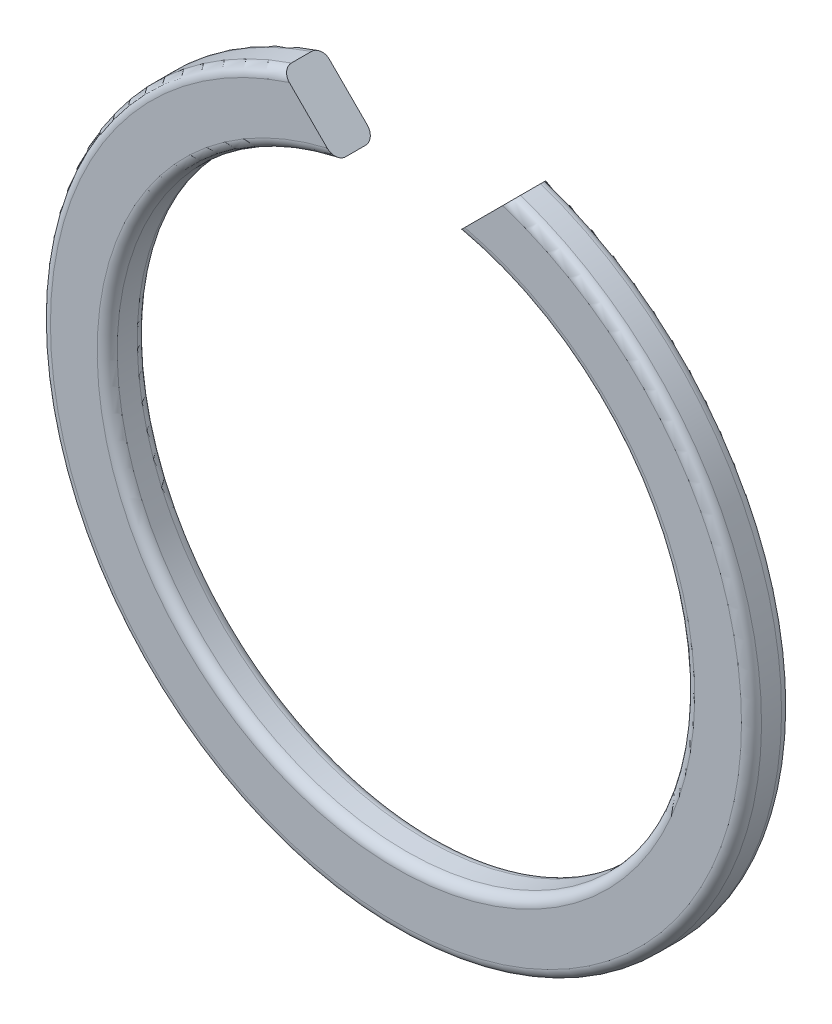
ISO-10303-21;
HEADER;
FILE_DESCRIPTION(('STEP AP214'),'2;1');
FILE_NAME('part.step','',(''),(''),'','','');
FILE_SCHEMA(('AUTOMOTIVE_DESIGN { 1 0 10303 214 1 1 1 1 }'));
ENDSEC;
DATA;
#1=APPLICATION_CONTEXT('core data for automotive mechanical design processes');
#2=APPLICATION_PROTOCOL_DEFINITION('international standard','automotive_design',2000,#1);
#3=PRODUCT_CONTEXT('',#1,'mechanical');
#4=PRODUCT('Part','Part','',(#3));
#5=PRODUCT_RELATED_PRODUCT_CATEGORY('part','',(#4));
#6=PRODUCT_DEFINITION_FORMATION('','',#4);
#7=PRODUCT_DEFINITION_CONTEXT('part definition',#1,'design');
#8=PRODUCT_DEFINITION('design','',#6,#7);
#9=PRODUCT_DEFINITION_SHAPE('','',#8);
#10=(LENGTH_UNIT() NAMED_UNIT(*) SI_UNIT(.MILLI.,.METRE.));
#11=(NAMED_UNIT(*) PLANE_ANGLE_UNIT() SI_UNIT($,.RADIAN.));
#12=(NAMED_UNIT(*) SI_UNIT($,.STERADIAN.) SOLID_ANGLE_UNIT());
#13=UNCERTAINTY_MEASURE_WITH_UNIT(LENGTH_MEASURE(1.E-05),#10,'distance_accuracy_value','');
#14=(GEOMETRIC_REPRESENTATION_CONTEXT(3) GLOBAL_UNCERTAINTY_ASSIGNED_CONTEXT((#13)) GLOBAL_UNIT_ASSIGNED_CONTEXT((#10,
#11,#12)) REPRESENTATION_CONTEXT('',''));
#15=CARTESIAN_POINT('',(0.,0.,0.));
#16=DIRECTION('',(0.,0.,1.));
#17=DIRECTION('',(1.,0.,0.));
#18=AXIS2_PLACEMENT_3D('',#15,#16,#17);
#19=CARTESIAN_POINT('',(0.,0.,1.2));
#20=DIRECTION('',(0.,0.,1.));
#21=DIRECTION('',(1.,0.,0.));
#22=AXIS2_PLACEMENT_3D('',#19,#20,#21);
#23=PLANE('',#22);
#24=DIRECTION('',(0.707106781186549,-0.707106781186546,0.));
#25=VECTOR('',#24,1.);
#26=CARTESIAN_POINT('',(0.,6.65,1.2));
#27=LINE('',#26,#25);
#28=CARTESIAN_POINT('',(-3.19463380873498,9.84463380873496,1.2));
#29=VERTEX_POINT('',#28);
#30=CARTESIAN_POINT('',(-2.05975858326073,8.70975858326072,1.2));
#31=VERTEX_POINT('',#30);
#32=EDGE_CURVE('E204',#29,#31,#27,.T.);
#33=ORIENTED_EDGE('',*,*,#32,.F.);
#34=CARTESIAN_POINT('',(0.,0.,1.2));
#35=DIRECTION('',(0.,0.,1.));
#36=DIRECTION('',(1.,0.,0.));
#37=AXIS2_PLACEMENT_3D('',#34,#35,#36);
#38=CIRCLE('',#37,10.35);
#39=CARTESIAN_POINT('',(3.19463380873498,9.84463380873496,1.2));
#40=VERTEX_POINT('',#39);
#41=EDGE_CURVE('E11',#29,#40,#38,.T.);
#42=ORIENTED_EDGE('',*,*,#41,.T.);
#43=DIRECTION('',(0.707106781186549,0.707106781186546,0.));
#44=VECTOR('',#43,1.);
#45=CARTESIAN_POINT('',(0.,6.65,1.2));
#46=LINE('',#45,#44);
#47=CARTESIAN_POINT('',(2.05975858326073,8.70975858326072,1.2));
#48=VERTEX_POINT('',#47);
#49=EDGE_CURVE('E203',#48,#40,#46,.T.);
#50=ORIENTED_EDGE('',*,*,#49,.F.);
#51=CARTESIAN_POINT('',(0.,0.,1.2));
#52=DIRECTION('',(0.,0.,1.));
#53=DIRECTION('',(1.,0.,0.));
#54=AXIS2_PLACEMENT_3D('',#51,#52,#53);
#55=CIRCLE('',#54,8.95);
#56=EDGE_CURVE('E42',#48,#31,#55,.F.);
#57=ORIENTED_EDGE('',*,*,#56,.T.);
#58=EDGE_LOOP('',(#33,#42,#50,#57));
#59=FACE_BOUND('',#58,.T.);
#60=ADVANCED_FACE('F33',(#59),#23,.T.);
#61=CARTESIAN_POINT('',(0.,0.,0.));
#62=DIRECTION('',(0.,0.,1.));
#63=DIRECTION('',(1.,0.,0.));
#64=AXIS2_PLACEMENT_3D('',#61,#62,#63);
#65=PLANE('',#64);
#66=DIRECTION('',(0.707106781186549,-0.707106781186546,0.));
#67=VECTOR('',#66,1.);
#68=CARTESIAN_POINT('',(0.,6.65,0.));
#69=LINE('',#68,#67);
#70=CARTESIAN_POINT('',(-3.19463380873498,9.84463380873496,0.));
#71=VERTEX_POINT('',#70);
#72=CARTESIAN_POINT('',(-2.05975858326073,8.70975858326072,0.));
#73=VERTEX_POINT('',#72);
#74=EDGE_CURVE('E105',#71,#73,#69,.T.);
#75=ORIENTED_EDGE('',*,*,#74,.T.);
#76=CARTESIAN_POINT('',(0.,0.,0.));
#77=DIRECTION('',(0.,0.,1.));
#78=DIRECTION('',(1.,0.,0.));
#79=AXIS2_PLACEMENT_3D('',#76,#77,#78);
#80=CIRCLE('',#79,8.95);
#81=CARTESIAN_POINT('',(2.05975858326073,8.70975858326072,0.));
#82=VERTEX_POINT('',#81);
#83=EDGE_CURVE('E111',#73,#82,#80,.T.);
#84=ORIENTED_EDGE('',*,*,#83,.T.);
#85=DIRECTION('',(0.707106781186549,0.707106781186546,0.));
#86=VECTOR('',#85,1.);
#87=CARTESIAN_POINT('',(0.,6.65,0.));
#88=LINE('',#87,#86);
#89=CARTESIAN_POINT('',(3.19463380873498,9.84463380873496,0.));
#90=VERTEX_POINT('',#89);
#91=EDGE_CURVE('E108',#82,#90,#88,.T.);
#92=ORIENTED_EDGE('',*,*,#91,.T.);
#93=CARTESIAN_POINT('',(0.,0.,0.));
#94=DIRECTION('',(0.,0.,1.));
#95=DIRECTION('',(1.,0.,0.));
#96=AXIS2_PLACEMENT_3D('',#93,#94,#95);
#97=CIRCLE('',#96,10.35);
#98=EDGE_CURVE('E101',#90,#71,#97,.F.);
#99=ORIENTED_EDGE('',*,*,#98,.T.);
#100=EDGE_LOOP('',(#75,#84,#92,#99));
#101=FACE_BOUND('',#100,.T.);
#102=ADVANCED_FACE('F103',(#101),#65,.F.);
#103=CARTESIAN_POINT('',(0.,0.,1.2));
#104=DIRECTION('',(0.,0.,-1.));
#105=DIRECTION('',(-1.,0.,0.));
#106=AXIS2_PLACEMENT_3D('',#103,#104,#105);
#107=CYLINDRICAL_SURFACE('',#106,10.65);
#108=DIRECTION('',(0.,0.,-1.));
#109=VECTOR('',#108,1.);
#110=CARTESIAN_POINT('',(-3.43189462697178,10.0818946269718,1.2));
#111=LINE('',#110,#109);
#112=CARTESIAN_POINT('',(-3.43189462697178,10.0818946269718,0.3));
#113=VERTEX_POINT('',#112);
#114=CARTESIAN_POINT('',(-3.43189462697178,10.0818946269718,0.9));
#115=VERTEX_POINT('',#114);
#116=EDGE_CURVE('E198',#113,#115,#111,.F.);
#117=ORIENTED_EDGE('',*,*,#116,.F.);
#118=CARTESIAN_POINT('',(0.,0.,0.3));
#119=DIRECTION('',(0.,0.,1.));
#120=DIRECTION('',(1.,0.,0.));
#121=AXIS2_PLACEMENT_3D('',#118,#119,#120);
#122=CIRCLE('',#121,10.65);
#123=CARTESIAN_POINT('',(3.43189462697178,10.0818946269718,0.3));
#124=VERTEX_POINT('',#123);
#125=EDGE_CURVE('E124',#113,#124,#122,.T.);
#126=ORIENTED_EDGE('',*,*,#125,.T.);
#127=DIRECTION('',(0.,0.,-1.));
#128=VECTOR('',#127,1.);
#129=CARTESIAN_POINT('',(3.43189462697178,10.0818946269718,1.2));
#130=LINE('',#129,#128);
#131=CARTESIAN_POINT('',(3.43189462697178,10.0818946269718,0.9));
#132=VERTEX_POINT('',#131);
#133=EDGE_CURVE('E200',#132,#124,#130,.T.);
#134=ORIENTED_EDGE('',*,*,#133,.F.);
#135=CARTESIAN_POINT('',(0.,0.,0.9));
#136=DIRECTION('',(0.,0.,1.));
#137=DIRECTION('',(1.,0.,0.));
#138=AXIS2_PLACEMENT_3D('',#135,#136,#137);
#139=CIRCLE('',#138,10.65);
#140=EDGE_CURVE('E126',#132,#115,#139,.F.);
#141=ORIENTED_EDGE('',*,*,#140,.T.);
#142=EDGE_LOOP('',(#117,#126,#134,#141));
#143=FACE_BOUND('',#142,.T.);
#144=ADVANCED_FACE('F233',(#143),#107,.T.);
#145=CARTESIAN_POINT('',(0.,0.,1.2));
#146=DIRECTION('',(0.,0.,-1.));
#147=DIRECTION('',(-1.,0.,0.));
#148=AXIS2_PLACEMENT_3D('',#145,#146,#147);
#149=CYLINDRICAL_SURFACE('',#148,8.65);
#150=DIRECTION('',(0.,0.,-1.));
#151=VECTOR('',#150,1.);
#152=CARTESIAN_POINT('',(1.80877297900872,8.45877297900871,1.2));
#153=LINE('',#152,#151);
#154=CARTESIAN_POINT('',(1.80877297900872,8.45877297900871,0.9));
#155=VERTEX_POINT('',#154);
#156=CARTESIAN_POINT('',(1.80877297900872,8.45877297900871,0.3));
#157=VERTEX_POINT('',#156);
#158=EDGE_CURVE('E195',#155,#157,#153,.T.);
#159=ORIENTED_EDGE('',*,*,#158,.T.);
#160=CARTESIAN_POINT('',(0.,0.,0.3));
#161=DIRECTION('',(0.,0.,1.));
#162=DIRECTION('',(1.,0.,0.));
#163=AXIS2_PLACEMENT_3D('',#160,#161,#162);
#164=CIRCLE('',#163,8.65);
#165=CARTESIAN_POINT('',(-1.80877297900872,8.45877297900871,0.3));
#166=VERTEX_POINT('',#165);
#167=EDGE_CURVE('E214',#157,#166,#164,.F.);
#168=ORIENTED_EDGE('',*,*,#167,.T.);
#169=DIRECTION('',(0.,0.,-1.));
#170=VECTOR('',#169,1.);
#171=CARTESIAN_POINT('',(-1.80877297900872,8.45877297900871,1.2));
#172=LINE('',#171,#170);
#173=CARTESIAN_POINT('',(-1.80877297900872,8.45877297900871,0.9));
#174=VERTEX_POINT('',#173);
#175=EDGE_CURVE('E112',#166,#174,#172,.F.);
#176=ORIENTED_EDGE('',*,*,#175,.T.);
#177=CARTESIAN_POINT('',(0.,0.,0.9));
#178=DIRECTION('',(0.,0.,1.));
#179=DIRECTION('',(1.,0.,0.));
#180=AXIS2_PLACEMENT_3D('',#177,#178,#179);
#181=CIRCLE('',#180,8.65);
#182=EDGE_CURVE('E213',#174,#155,#181,.T.);
#183=ORIENTED_EDGE('',*,*,#182,.T.);
#184=EDGE_LOOP('',(#159,#168,#176,#183));
#185=FACE_BOUND('',#184,.T.);
#186=ADVANCED_FACE('F181',(#185),#149,.F.);
#187=CARTESIAN_POINT('',(0.,6.65,1.2));
#188=DIRECTION('',(-0.707106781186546,0.707106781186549,0.));
#189=DIRECTION('',(-0.707106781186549,-0.707106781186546,0.));
#190=AXIS2_PLACEMENT_3D('',#187,#188,#189);
#191=PLANE('',#190);
#192=ORIENTED_EDGE('',*,*,#91,.F.);
#193=CARTESIAN_POINT('',(2.05975858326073,8.70975858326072,0.));
#194=CARTESIAN_POINT('',(2.04174408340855,8.69174408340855,-7.87351634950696E-07));
#195=CARTESIAN_POINT('',(2.02370472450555,8.67370472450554,0.00235106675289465));
#196=CARTESIAN_POINT('',(1.98811823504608,8.63811823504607,0.011770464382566));
#197=CARTESIAN_POINT('',(1.97057569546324,8.62057569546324,0.0188725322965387));
#198=CARTESIAN_POINT('',(1.93854923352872,8.58854923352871,0.0368269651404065));
#199=CARTESIAN_POINT('',(1.9239364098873,8.57393640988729,0.0472174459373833));
#200=CARTESIAN_POINT('',(1.89641223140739,8.54641223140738,0.0717211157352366));
#201=CARTESIAN_POINT('',(1.88349420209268,8.53349420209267,0.0858190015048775));
#202=CARTESIAN_POINT('',(1.86329961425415,8.51329961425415,0.113119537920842));
#203=CARTESIAN_POINT('',(1.85545278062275,8.50545278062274,0.125482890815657));
#204=CARTESIAN_POINT('',(1.84129975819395,8.49129975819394,0.151886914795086));
#205=CARTESIAN_POINT('',(1.83499383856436,8.48499383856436,0.165927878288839));
#206=CARTESIAN_POINT('',(1.82421017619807,8.47421017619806,0.195482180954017));
#207=CARTESIAN_POINT('',(1.81974541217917,8.46974541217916,0.211005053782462));
#208=CARTESIAN_POINT('',(1.81299859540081,8.4629985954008,0.242956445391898));
#209=CARTESIAN_POINT('',(1.81071086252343,8.46071086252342,0.259382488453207));
#210=CARTESIAN_POINT('',(1.80931580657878,8.45931580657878,0.279936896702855));
#211=CARTESIAN_POINT('',(1.80911223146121,8.4591122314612,0.283946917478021));
#212=CARTESIAN_POINT('',(1.80884105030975,8.45884105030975,0.291970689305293));
#213=CARTESIAN_POINT('',(1.80877325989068,8.45877325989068,0.295984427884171));
#214=CARTESIAN_POINT('',(1.80877297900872,8.45877297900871,0.3));
#215=B_SPLINE_CURVE_WITH_KNOTS('',3,(#193,#194,#195,#196,#197,#198,#199,#200,#201,#202,#203,
#204,#205,#206,#207,#208,#209,#210,#211,#212,#213,#214),.UNSPECIFIED.,.F.,.F.,(4,2,2,2,2,2,2,2,
2,2,4),(0.,0.0763846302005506,0.153330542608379,0.222347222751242,0.291083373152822,
0.340724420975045,0.390374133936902,0.440368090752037,0.490231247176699,0.502289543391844,
0.51433145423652),.UNSPECIFIED.);
#216=EDGE_CURVE('E166',#82,#157,#215,.T.);
#217=ORIENTED_EDGE('',*,*,#216,.T.);
#218=ORIENTED_EDGE('',*,*,#158,.F.);
#219=CARTESIAN_POINT('',(1.80877297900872,8.45877297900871,0.9));
#220=CARTESIAN_POINT('',(1.80875535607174,8.45875535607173,0.914976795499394));
#221=CARTESIAN_POINT('',(1.80971655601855,8.45971655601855,0.929933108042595));
#222=CARTESIAN_POINT('',(1.81345164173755,8.46345164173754,0.959310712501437));
#223=CARTESIAN_POINT('',(1.81621628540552,8.46621628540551,0.973734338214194));
#224=CARTESIAN_POINT('',(1.82341160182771,8.4734116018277,1.00169656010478));
#225=CARTESIAN_POINT('',(1.82784027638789,8.47784027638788,1.01523619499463));
#226=CARTESIAN_POINT('',(1.83815152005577,8.48815152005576,1.04116725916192));
#227=CARTESIAN_POINT('',(1.84403565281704,8.49403565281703,1.05355743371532));
#228=CARTESIAN_POINT('',(1.85742644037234,8.50742644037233,1.07769578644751));
#229=CARTESIAN_POINT('',(1.86501069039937,8.51501069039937,1.08935746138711));
#230=CARTESIAN_POINT('',(1.88128708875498,8.53128708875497,1.11100295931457));
#231=CARTESIAN_POINT('',(1.88997944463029,8.53997944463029,1.12098646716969));
#232=CARTESIAN_POINT('',(1.90963141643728,8.55963141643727,1.14060092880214));
#233=CARTESIAN_POINT('',(1.92073445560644,8.57073445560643,1.14994434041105));
#234=CARTESIAN_POINT('',(1.94378632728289,8.59378632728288,1.16626908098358));
#235=CARTESIAN_POINT('',(1.95573627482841,8.6057362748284,1.17324722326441));
#236=CARTESIAN_POINT('',(1.98274279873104,8.63274279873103,1.18601819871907));
#237=CARTESIAN_POINT('',(1.99792921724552,8.64792921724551,1.19126404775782));
#238=CARTESIAN_POINT('',(2.02866841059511,8.6786684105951,1.19825142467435));
#239=CARTESIAN_POINT('',(2.04422034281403,8.69422034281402,1.20000033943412));
#240=CARTESIAN_POINT('',(2.05975858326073,8.70975858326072,1.2));
#241=B_SPLINE_CURVE_WITH_KNOTS('',3,(#219,#220,#221,#222,#223,#224,#225,#226,#227,#228,#229,
#230,#231,#232,#233,#234,#235,#236,#237,#238,#239,#240),.UNSPECIFIED.,.F.,.F.,(4,2,2,2,2,2,2,2,
2,2,4),(0.,0.044836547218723,0.0894451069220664,0.134000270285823,0.178603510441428,
0.225953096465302,0.273311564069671,0.327914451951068,0.382590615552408,0.448619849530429,
0.514509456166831),.UNSPECIFIED.);
#242=EDGE_CURVE('E185',#155,#48,#241,.T.);
#243=ORIENTED_EDGE('',*,*,#242,.T.);
#244=ORIENTED_EDGE('',*,*,#49,.T.);
#245=CARTESIAN_POINT('',(3.19463380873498,9.84463380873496,1.2));
#246=CARTESIAN_POINT('',(3.20924872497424,9.85924872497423,1.20000608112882));
#247=CARTESIAN_POINT('',(3.22387232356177,9.87387232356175,1.19830466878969));
#248=CARTESIAN_POINT('',(3.25276815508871,9.90276815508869,1.19149765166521));
#249=CARTESIAN_POINT('',(3.26703900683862,9.91703900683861,1.18638036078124));
#250=CARTESIAN_POINT('',(3.29478072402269,9.94478072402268,1.17273962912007));
#251=CARTESIAN_POINT('',(3.30825001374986,9.95825001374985,1.16420971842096));
#252=CARTESIAN_POINT('',(3.3338666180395,9.98386661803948,1.14385243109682));
#253=CARTESIAN_POINT('',(3.34601577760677,9.99601577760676,1.13202974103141));
#254=CARTESIAN_POINT('',(3.36771317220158,10.0177131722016,1.106226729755));
#255=CARTESIAN_POINT('',(3.37738306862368,10.0273830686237,1.09245173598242));
#256=CARTESIAN_POINT('',(3.39470195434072,10.0447019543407,1.06254249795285));
#257=CARTESIAN_POINT('',(3.40235154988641,10.0523515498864,1.04640896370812));
#258=CARTESIAN_POINT('',(3.41449004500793,10.0644900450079,1.01420551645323));
#259=CARTESIAN_POINT('',(3.41923617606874,10.0692361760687,0.998328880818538));
#260=CARTESIAN_POINT('',(3.42655562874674,10.0765556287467,0.965620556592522));
#261=CARTESIAN_POINT('',(3.42913406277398,10.079134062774,0.948791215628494));
#262=CARTESIAN_POINT('',(3.43100679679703,10.081006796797,0.92651685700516));
#263=CARTESIAN_POINT('',(3.43133975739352,10.0813397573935,0.92122039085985));
#264=CARTESIAN_POINT('',(3.4317833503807,10.0817833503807,0.910616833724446));
#265=CARTESIAN_POINT('',(3.43189431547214,10.0818943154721,0.90530977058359));
#266=CARTESIAN_POINT('',(3.43189462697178,10.0818946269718,0.9));
#267=B_SPLINE_CURVE_WITH_KNOTS('',3,(#245,#246,#247,#248,#249,#250,#251,#252,#253,#254,#255,
#256,#257,#258,#259,#260,#261,#262,#263,#264,#265,#266),.UNSPECIFIED.,.F.,.F.,(4,2,2,2,2,2,2,2,
2,2,4),(0.,0.0619565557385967,0.124126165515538,0.186414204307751,0.248614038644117,
0.306519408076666,0.36440738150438,0.415844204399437,0.467159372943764,0.483104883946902,
0.499026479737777),.UNSPECIFIED.);
#268=EDGE_CURVE('E167',#40,#132,#267,.T.);
#269=ORIENTED_EDGE('',*,*,#268,.T.);
#270=ORIENTED_EDGE('',*,*,#133,.T.);
#271=CARTESIAN_POINT('',(3.43189462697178,10.0818946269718,0.3));
#272=CARTESIAN_POINT('',(3.43190940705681,10.0819094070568,0.284373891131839));
#273=CARTESIAN_POINT('',(3.43093352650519,10.0809335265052,0.268761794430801));
#274=CARTESIAN_POINT('',(3.42711806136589,10.0771180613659,0.238054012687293));
#275=CARTESIAN_POINT('',(3.42428500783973,10.0742850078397,0.222956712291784));
#276=CARTESIAN_POINT('',(3.41687323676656,10.0668732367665,0.19365900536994));
#277=CARTESIAN_POINT('',(3.41229541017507,10.0622954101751,0.179458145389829));
#278=CARTESIAN_POINT('',(3.40158221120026,10.0515822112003,0.152281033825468));
#279=CARTESIAN_POINT('',(3.39544590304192,10.0454459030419,0.139305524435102));
#280=CARTESIAN_POINT('',(3.38156080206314,10.0315608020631,0.114358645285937));
#281=CARTESIAN_POINT('',(3.37375713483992,10.0237571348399,0.102448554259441));
#282=CARTESIAN_POINT('',(3.35696073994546,10.0069607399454,0.080451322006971));
#283=CARTESIAN_POINT('',(3.34796775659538,9.99796775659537,0.0703645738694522));
#284=CARTESIAN_POINT('',(3.32812177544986,9.97812177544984,0.051256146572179));
#285=CARTESIAN_POINT('',(3.3171729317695,9.96717293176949,0.0424337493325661));
#286=CARTESIAN_POINT('',(3.29445156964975,9.94445156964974,0.0272332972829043));
#287=CARTESIAN_POINT('',(3.28267833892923,9.93267833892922,0.020857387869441));
#288=CARTESIAN_POINT('',(3.25832626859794,9.90832626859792,0.0104865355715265));
#289=CARTESIAN_POINT('',(3.24573514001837,9.89573514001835,0.00654960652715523));
#290=CARTESIAN_POINT('',(3.22030521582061,9.8703052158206,0.00130702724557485));
#291=CARTESIAN_POINT('',(3.20746692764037,9.85746692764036,-3.53211850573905E-06));
#292=CARTESIAN_POINT('',(3.19463380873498,9.84463380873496,0.));
#293=B_SPLINE_CURVE_WITH_KNOTS('',3,(#271,#272,#273,#274,#275,#276,#277,#278,#279,#280,#281,
#282,#283,#284,#285,#286,#287,#288,#289,#290,#291,#292),.UNSPECIFIED.,.F.,.F.,(4,2,2,2,2,2,2,2,
2,2,4),(0.,0.046795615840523,0.0934275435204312,0.140035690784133,0.186671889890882,
0.235181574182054,0.283701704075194,0.336945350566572,0.390235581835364,0.44474907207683,
0.49916057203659),.UNSPECIFIED.);
#294=EDGE_CURVE('E159',#124,#90,#293,.T.);
#295=ORIENTED_EDGE('',*,*,#294,.T.);
#296=EDGE_LOOP('',(#192,#217,#218,#243,#244,#269,#270,#295));
#297=FACE_BOUND('',#296,.T.);
#298=ADVANCED_FACE('F178',(#297),#191,.T.);
#299=CARTESIAN_POINT('',(0.,6.65,1.2));
#300=DIRECTION('',(0.707106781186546,0.707106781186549,0.));
#301=DIRECTION('',(-0.707106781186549,0.707106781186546,0.));
#302=AXIS2_PLACEMENT_3D('',#299,#300,#301);
#303=PLANE('',#302);
#304=ORIENTED_EDGE('',*,*,#175,.F.);
#305=CARTESIAN_POINT('',(-1.80877297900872,8.45877297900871,0.3));
#306=CARTESIAN_POINT('',(-1.80875535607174,8.45875535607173,0.285023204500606));
#307=CARTESIAN_POINT('',(-1.80971655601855,8.45971655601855,0.270066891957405));
#308=CARTESIAN_POINT('',(-1.81345164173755,8.46345164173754,0.240689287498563));
#309=CARTESIAN_POINT('',(-1.81621628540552,8.46621628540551,0.226265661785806));
#310=CARTESIAN_POINT('',(-1.82341160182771,8.4734116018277,0.198303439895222));
#311=CARTESIAN_POINT('',(-1.82784027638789,8.47784027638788,0.184763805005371));
#312=CARTESIAN_POINT('',(-1.83815152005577,8.48815152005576,0.158832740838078));
#313=CARTESIAN_POINT('',(-1.84403565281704,8.49403565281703,0.146442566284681));
#314=CARTESIAN_POINT('',(-1.85742644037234,8.50742644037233,0.122304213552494));
#315=CARTESIAN_POINT('',(-1.86501069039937,8.51501069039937,0.110642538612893));
#316=CARTESIAN_POINT('',(-1.88128708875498,8.53128708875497,0.0889970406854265));
#317=CARTESIAN_POINT('',(-1.88997944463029,8.53997944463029,0.079013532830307));
#318=CARTESIAN_POINT('',(-1.90963141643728,8.55963141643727,0.0593990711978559));
#319=CARTESIAN_POINT('',(-1.92073445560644,8.57073445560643,0.0500556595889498));
#320=CARTESIAN_POINT('',(-1.94378632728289,8.59378632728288,0.0337309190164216));
#321=CARTESIAN_POINT('',(-1.95573627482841,8.6057362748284,0.0267527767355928));
#322=CARTESIAN_POINT('',(-1.98274279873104,8.63274279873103,0.0139818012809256));
#323=CARTESIAN_POINT('',(-1.99792921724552,8.64792921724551,0.00873595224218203));
#324=CARTESIAN_POINT('',(-2.02866841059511,8.6786684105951,0.00174857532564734));
#325=CARTESIAN_POINT('',(-2.04422034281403,8.69422034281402,-3.39434118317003E-07));
#326=CARTESIAN_POINT('',(-2.05975858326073,8.70975858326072,0.));
#327=B_SPLINE_CURVE_WITH_KNOTS('',3,(#305,#306,#307,#308,#309,#310,#311,#312,#313,#314,#315,
#316,#317,#318,#319,#320,#321,#322,#323,#324,#325,#326),.UNSPECIFIED.,.F.,.F.,(4,2,2,2,2,2,2,2,
2,2,4),(0.,0.0448365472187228,0.0894451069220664,0.134000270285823,0.178603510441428,
0.225953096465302,0.273311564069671,0.327914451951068,0.382590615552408,0.448619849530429,
0.514509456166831),.UNSPECIFIED.);
#328=EDGE_CURVE('E119',#166,#73,#327,.T.);
#329=ORIENTED_EDGE('',*,*,#328,.T.);
#330=ORIENTED_EDGE('',*,*,#74,.F.);
#331=CARTESIAN_POINT('',(-3.19463380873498,9.84463380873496,0.));
#332=CARTESIAN_POINT('',(-3.20924872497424,9.85924872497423,-6.08112882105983E-06));
#333=CARTESIAN_POINT('',(-3.22387232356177,9.87387232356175,0.00169533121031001));
#334=CARTESIAN_POINT('',(-3.25276815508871,9.90276815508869,0.00850234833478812));
#335=CARTESIAN_POINT('',(-3.26703900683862,9.91703900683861,0.0136196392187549));
#336=CARTESIAN_POINT('',(-3.29478072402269,9.94478072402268,0.0272603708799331));
#337=CARTESIAN_POINT('',(-3.30825001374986,9.95825001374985,0.0357902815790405));
#338=CARTESIAN_POINT('',(-3.3338666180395,9.98386661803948,0.0561475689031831));
#339=CARTESIAN_POINT('',(-3.34601577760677,9.99601577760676,0.0679702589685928));
#340=CARTESIAN_POINT('',(-3.36771317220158,10.0177131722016,0.0937732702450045));
#341=CARTESIAN_POINT('',(-3.37738306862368,10.0273830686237,0.107548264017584));
#342=CARTESIAN_POINT('',(-3.39470195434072,10.0447019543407,0.137457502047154));
#343=CARTESIAN_POINT('',(-3.40235154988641,10.0523515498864,0.153591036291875));
#344=CARTESIAN_POINT('',(-3.41449004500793,10.0644900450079,0.185794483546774));
#345=CARTESIAN_POINT('',(-3.41923617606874,10.0692361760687,0.201671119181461));
#346=CARTESIAN_POINT('',(-3.42655562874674,10.0765556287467,0.234379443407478));
#347=CARTESIAN_POINT('',(-3.42913406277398,10.079134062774,0.251208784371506));
#348=CARTESIAN_POINT('',(-3.43100679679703,10.081006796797,0.27348314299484));
#349=CARTESIAN_POINT('',(-3.43133975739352,10.0813397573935,0.27877960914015));
#350=CARTESIAN_POINT('',(-3.4317833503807,10.0817833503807,0.289383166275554));
#351=CARTESIAN_POINT('',(-3.43189431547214,10.0818943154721,0.29469022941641));
#352=CARTESIAN_POINT('',(-3.43189462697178,10.0818946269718,0.3));
#353=B_SPLINE_CURVE_WITH_KNOTS('',3,(#331,#332,#333,#334,#335,#336,#337,#338,#339,#340,#341,
#342,#343,#344,#345,#346,#347,#348,#349,#350,#351,#352),.UNSPECIFIED.,.F.,.F.,(4,2,2,2,2,2,2,2,
2,2,4),(0.,0.0619565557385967,0.124126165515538,0.186414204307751,0.248614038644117,
0.306519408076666,0.36440738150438,0.415844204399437,0.467159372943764,0.483104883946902,
0.499026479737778),.UNSPECIFIED.);
#354=EDGE_CURVE('E116',#71,#113,#353,.T.);
#355=ORIENTED_EDGE('',*,*,#354,.T.);
#356=ORIENTED_EDGE('',*,*,#116,.T.);
#357=CARTESIAN_POINT('',(-3.43189462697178,10.0818946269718,0.9));
#358=CARTESIAN_POINT('',(-3.43190940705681,10.0819094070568,0.91562610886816));
#359=CARTESIAN_POINT('',(-3.43093352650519,10.0809335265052,0.931238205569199));
#360=CARTESIAN_POINT('',(-3.42711806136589,10.0771180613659,0.961945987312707));
#361=CARTESIAN_POINT('',(-3.42428500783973,10.0742850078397,0.977043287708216));
#362=CARTESIAN_POINT('',(-3.41687323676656,10.0668732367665,1.00634099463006));
#363=CARTESIAN_POINT('',(-3.41229541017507,10.0622954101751,1.02054185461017));
#364=CARTESIAN_POINT('',(-3.40158221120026,10.0515822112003,1.04771896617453));
#365=CARTESIAN_POINT('',(-3.39544590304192,10.0454459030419,1.0606944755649));
#366=CARTESIAN_POINT('',(-3.38156080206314,10.0315608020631,1.08564135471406));
#367=CARTESIAN_POINT('',(-3.37375713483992,10.0237571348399,1.09755144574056));
#368=CARTESIAN_POINT('',(-3.35696073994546,10.0069607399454,1.11954867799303));
#369=CARTESIAN_POINT('',(-3.34796775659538,9.99796775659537,1.12963542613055));
#370=CARTESIAN_POINT('',(-3.32812177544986,9.97812177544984,1.14874385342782));
#371=CARTESIAN_POINT('',(-3.3171729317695,9.96717293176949,1.15756625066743));
#372=CARTESIAN_POINT('',(-3.29445156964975,9.94445156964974,1.1727667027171));
#373=CARTESIAN_POINT('',(-3.28267833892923,9.93267833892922,1.17914261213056));
#374=CARTESIAN_POINT('',(-3.25832626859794,9.90832626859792,1.18951346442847));
#375=CARTESIAN_POINT('',(-3.24573514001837,9.89573514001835,1.19345039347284));
#376=CARTESIAN_POINT('',(-3.22030521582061,9.8703052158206,1.19869297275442));
#377=CARTESIAN_POINT('',(-3.20746692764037,9.85746692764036,1.20000353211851));
#378=CARTESIAN_POINT('',(-3.19463380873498,9.84463380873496,1.2));
#379=B_SPLINE_CURVE_WITH_KNOTS('',3,(#357,#358,#359,#360,#361,#362,#363,#364,#365,#366,#367,
#368,#369,#370,#371,#372,#373,#374,#375,#376,#377,#378),.UNSPECIFIED.,.F.,.F.,(4,2,2,2,2,2,2,2,
2,2,4),(0.,0.046795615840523,0.0934275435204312,0.140035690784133,0.186671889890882,
0.235181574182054,0.283701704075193,0.336945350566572,0.390235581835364,0.44474907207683,
0.49916057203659),.UNSPECIFIED.);
#380=EDGE_CURVE('E55',#115,#29,#379,.T.);
#381=ORIENTED_EDGE('',*,*,#380,.T.);
#382=ORIENTED_EDGE('',*,*,#32,.T.);
#383=CARTESIAN_POINT('',(-2.05975858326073,8.70975858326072,1.2));
#384=CARTESIAN_POINT('',(-2.04174408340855,8.69174408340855,1.20000078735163));
#385=CARTESIAN_POINT('',(-2.02370472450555,8.67370472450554,1.19764893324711));
#386=CARTESIAN_POINT('',(-1.98811823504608,8.63811823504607,1.18822953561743));
#387=CARTESIAN_POINT('',(-1.97057569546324,8.62057569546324,1.18112746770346));
#388=CARTESIAN_POINT('',(-1.93854923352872,8.58854923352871,1.16317303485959));
#389=CARTESIAN_POINT('',(-1.9239364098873,8.57393640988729,1.15278255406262));
#390=CARTESIAN_POINT('',(-1.89641223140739,8.54641223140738,1.12827888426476));
#391=CARTESIAN_POINT('',(-1.88349420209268,8.53349420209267,1.11418099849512));
#392=CARTESIAN_POINT('',(-1.86329961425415,8.51329961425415,1.08688046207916));
#393=CARTESIAN_POINT('',(-1.85545278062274,8.50545278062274,1.07451710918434));
#394=CARTESIAN_POINT('',(-1.84129975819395,8.49129975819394,1.04811308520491));
#395=CARTESIAN_POINT('',(-1.83499383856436,8.48499383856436,1.03407212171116));
#396=CARTESIAN_POINT('',(-1.82421017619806,8.47421017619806,1.00451781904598));
#397=CARTESIAN_POINT('',(-1.81974541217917,8.46974541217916,0.988994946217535));
#398=CARTESIAN_POINT('',(-1.81299859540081,8.4629985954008,0.9570435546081));
#399=CARTESIAN_POINT('',(-1.81071086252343,8.46071086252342,0.940617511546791));
#400=CARTESIAN_POINT('',(-1.80931580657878,8.45931580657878,0.920063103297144));
#401=CARTESIAN_POINT('',(-1.80911223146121,8.4591122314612,0.916053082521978));
#402=CARTESIAN_POINT('',(-1.80884105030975,8.45884105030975,0.908029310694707));
#403=CARTESIAN_POINT('',(-1.80877325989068,8.45877325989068,0.904015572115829));
#404=CARTESIAN_POINT('',(-1.80877297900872,8.45877297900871,0.9));
#405=B_SPLINE_CURVE_WITH_KNOTS('',3,(#383,#384,#385,#386,#387,#388,#389,#390,#391,#392,#393,
#394,#395,#396,#397,#398,#399,#400,#401,#402,#403,#404),.UNSPECIFIED.,.F.,.F.,(4,2,2,2,2,2,2,2,
2,2,4),(0.,0.0763846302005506,0.153330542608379,0.222347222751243,0.291083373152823,
0.340724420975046,0.390374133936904,0.440368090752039,0.4902312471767,0.502289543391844,
0.51433145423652),.UNSPECIFIED.);
#406=EDGE_CURVE('E128',#31,#174,#405,.T.);
#407=ORIENTED_EDGE('',*,*,#406,.T.);
#408=EDGE_LOOP('',(#304,#329,#330,#355,#356,#381,#382,#407));
#409=FACE_BOUND('',#408,.T.);
#410=ADVANCED_FACE('F115',(#409),#303,.T.);
#411=CARTESIAN_POINT('',(0.,0.,0.3));
#412=DIRECTION('',(0.,0.,1.));
#413=DIRECTION('',(1.,0.,0.));
#414=AXIS2_PLACEMENT_3D('',#411,#412,#413);
#415=TOROIDAL_SURFACE('',#414,8.95,0.3);
#416=ORIENTED_EDGE('',*,*,#328,.F.);
#417=ORIENTED_EDGE('',*,*,#167,.F.);
#418=ORIENTED_EDGE('',*,*,#216,.F.);
#419=ORIENTED_EDGE('',*,*,#83,.F.);
#420=EDGE_LOOP('',(#416,#417,#418,#419));
#421=FACE_BOUND('',#420,.T.);
#422=ADVANCED_FACE('F153',(#421),#415,.T.);
#423=CARTESIAN_POINT('',(0.,0.,0.3));
#424=DIRECTION('',(0.,0.,1.));
#425=DIRECTION('',(1.,0.,0.));
#426=AXIS2_PLACEMENT_3D('',#423,#424,#425);
#427=TOROIDAL_SURFACE('',#426,10.35,0.3);
#428=ORIENTED_EDGE('',*,*,#354,.F.);
#429=ORIENTED_EDGE('',*,*,#98,.F.);
#430=ORIENTED_EDGE('',*,*,#294,.F.);
#431=ORIENTED_EDGE('',*,*,#125,.F.);
#432=EDGE_LOOP('',(#428,#429,#430,#431));
#433=FACE_BOUND('',#432,.T.);
#434=ADVANCED_FACE('F122',(#433),#427,.T.);
#435=CARTESIAN_POINT('',(0.,0.,0.9));
#436=DIRECTION('',(0.,0.,1.));
#437=DIRECTION('',(1.,0.,0.));
#438=AXIS2_PLACEMENT_3D('',#435,#436,#437);
#439=TOROIDAL_SURFACE('',#438,10.35,0.3);
#440=ORIENTED_EDGE('',*,*,#380,.F.);
#441=ORIENTED_EDGE('',*,*,#140,.F.);
#442=ORIENTED_EDGE('',*,*,#268,.F.);
#443=ORIENTED_EDGE('',*,*,#41,.F.);
#444=EDGE_LOOP('',(#440,#441,#442,#443));
#445=FACE_BOUND('',#444,.T.);
#446=ADVANCED_FACE('F152',(#445),#439,.T.);
#447=CARTESIAN_POINT('',(0.,0.,0.9));
#448=DIRECTION('',(0.,0.,1.));
#449=DIRECTION('',(1.,0.,0.));
#450=AXIS2_PLACEMENT_3D('',#447,#448,#449);
#451=TOROIDAL_SURFACE('',#450,8.95,0.3);
#452=ORIENTED_EDGE('',*,*,#406,.F.);
#453=ORIENTED_EDGE('',*,*,#56,.F.);
#454=ORIENTED_EDGE('',*,*,#242,.F.);
#455=ORIENTED_EDGE('',*,*,#182,.F.);
#456=EDGE_LOOP('',(#452,#453,#454,#455));
#457=FACE_BOUND('',#456,.T.);
#458=ADVANCED_FACE('F35',(#457),#451,.T.);
#459=CLOSED_SHELL('',(#60,#102,#144,#186,#298,#410,#422,#434,#446,#458));
#460=MANIFOLD_SOLID_BREP('B2',#459);
#461=ADVANCED_BREP_SHAPE_REPRESENTATION('',(#18,#460),#14);
#462=SHAPE_DEFINITION_REPRESENTATION(#9,#461);
ENDSEC;
END-ISO-10303-21;
